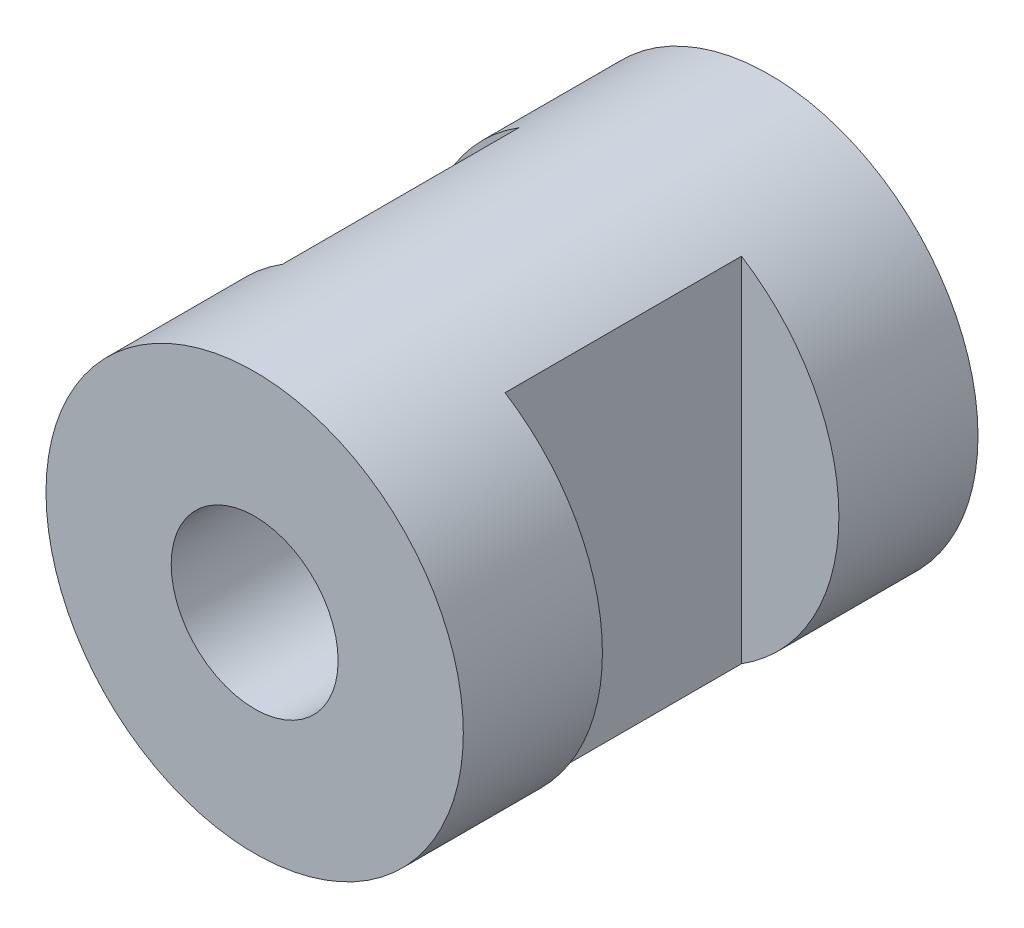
from build123d import *

# Parameters (mm, degrees)
SKETCH_1_R          = 7.5
EXTRUDE_1_DEPTH     = 18.5
SKETCH_2_W          = 5.128982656
SKETCH_2_H          = 8.5
CUT_EXTRUDE_1_DEPTH = 18.5
SKETCH_3_R          = 3
CUT_EXTRUDE_2_DEPTH = 18.5


with BuildPart() as part:
    # Sketch 1 → Extrude 1 (new body)
    with BuildSketch(Plane.XY):
        Circle(SKETCH_1_R)
    extrude(amount=EXTRUDE_1_DEPTH)

    # Sketch 2 → Cut-Extrude 1 (cut)
    with BuildSketch(Plane(origin=(0, 10, 0), x_dir=(-1, 0, 0), z_dir=(0, 1, 0))):
        with Locations((-6.564491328, 9.25)):
            Rectangle(SKETCH_2_W, SKETCH_2_H)
        with Locations((6.564491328, 9.25)):
            Rectangle(SKETCH_2_W, SKETCH_2_H)
    extrude(amount=-CUT_EXTRUDE_1_DEPTH, mode=Mode.SUBTRACT)

    # Sketch 3 → Cut-Extrude 2 (cut)
    with BuildSketch(Plane(origin=(0, 0, 0), x_dir=(-1, 0, 0), z_dir=(0, 0, -1))):
        Circle(SKETCH_3_R)
    extrude(amount=-CUT_EXTRUDE_2_DEPTH, mode=Mode.SUBTRACT)


solid = part.part
